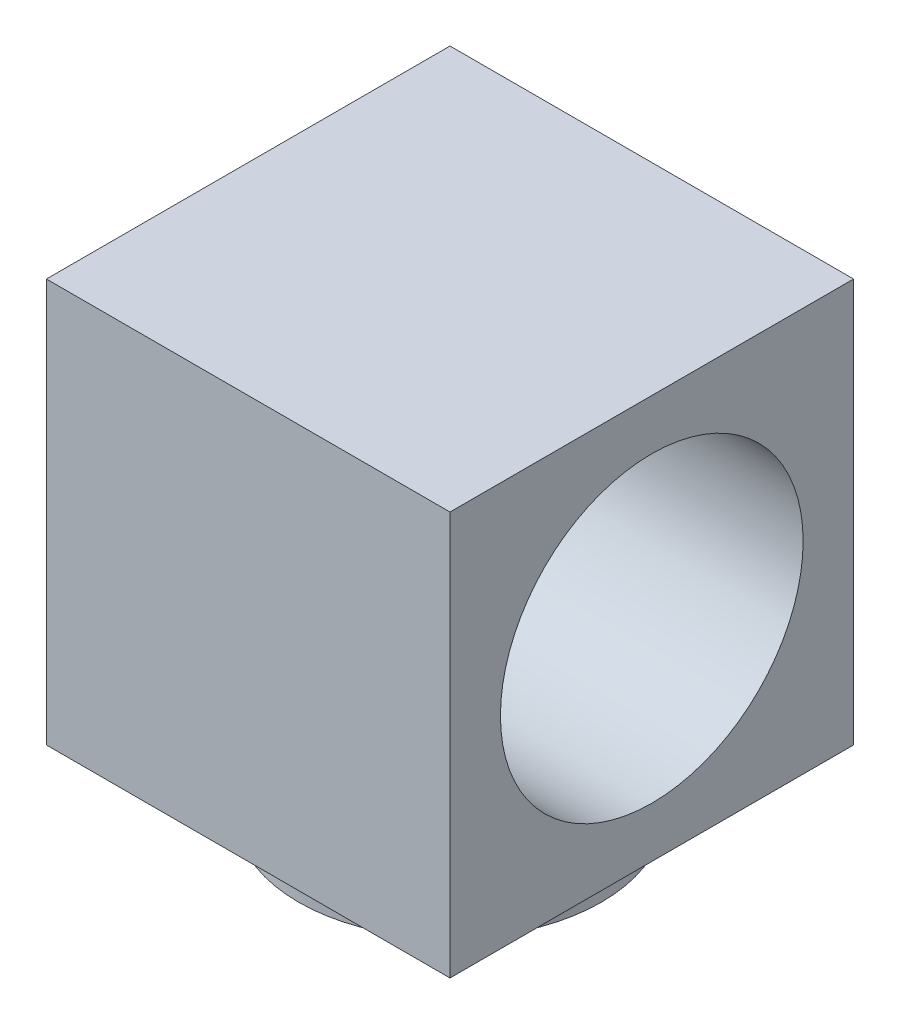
from build123d import *

# Parameters (mm, degrees)
SKETCH1_W           = 200
SKETCH1_H           = 200
BOSS_EXTRUDE1_DEPTH = 200
SKETCH2_R           = 75
CUT_EXTRUDE1_DEPTH  = 200
SKETCH3_R           = 75
SKETCH3_R_2         = 65
BOSS_EXTRUDE2_DEPTH = 30


with BuildPart() as part:
    # Sketch1 → Boss-Extrude1 (new body)
    with BuildSketch(Plane.XY):
        with Locations((69.095935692, -78.65258427)):
            Rectangle(SKETCH1_W, SKETCH1_H)
    extrude(amount=BOSS_EXTRUDE1_DEPTH)

    # Sketch2 → Cut-Extrude1 (cut)
    with BuildSketch(Plane(origin=(169.095935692, 0, 0), x_dir=(0, 0, -1), z_dir=(1, 0, 0))):
        with Locations(Location((-100, -78.65258427, 0), (0, 0, 90))):
            Circle(SKETCH2_R)
    extrude(amount=-CUT_EXTRUDE1_DEPTH, mode=Mode.SUBTRACT)

    # Sketch3 → Boss-Extrude2 (add)
    with BuildSketch(Plane(origin=(0, -178.65258427, 0), x_dir=(-1, 0, 0), z_dir=(0, -1, 0))):
        with Locations(Location((-69.095935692, -100, 0), (0, 0, 270))):
            Circle(SKETCH3_R)
        with Locations(Location((-69.095935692, -100, 0), (0, 0, 90))):
            Circle(SKETCH3_R_2, mode=Mode.SUBTRACT)
    extrude(amount=BOSS_EXTRUDE2_DEPTH)


solid = part.part
